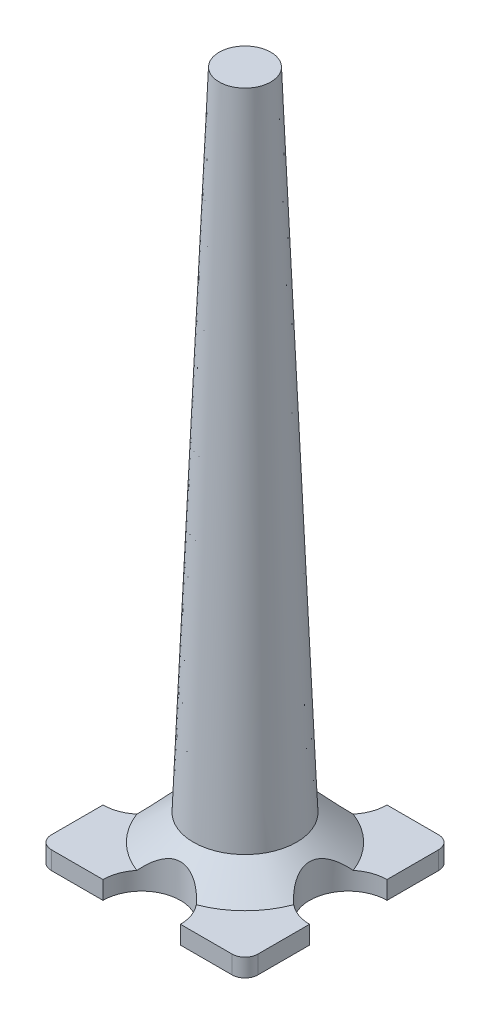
from build123d import *

# Parameters (mm, degrees)
BOSS_EXTRUDE1_DEPTH = 8.89
SKETCH5_R           = 19.05
CUT_EXTRUDE2_DEPTH  = 76.016052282


with BuildPart() as part:
    # Sketch1 → Boss-Extrude1 (new body)
    with BuildSketch(Plane(origin=(0, 0, 0), x_dir=(1, 0, 0), z_dir=(0, 1, 0))):
        with BuildLine():
            Line((44.45, -50.8), (-44.45, -50.8))
            ThreePointArc((-44.45, -50.8), (-48.940128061, -48.940128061), (-50.8, -44.45))
            Line((-50.8, -44.45), (-50.8, 44.45))
            ThreePointArc((-50.8, 44.45), (-48.940128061, 48.940128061), (-44.45, 50.8))
            Line((-44.45, 50.8), (44.45, 50.8))
            ThreePointArc((44.45, 50.8), (48.940128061, 48.940128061), (50.8, 44.45))
            Line((50.8, 44.45), (50.8, -44.45))
            ThreePointArc((50.8, -44.45), (48.940128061, -48.940128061), (44.45, -50.8))
        make_face()
    extrude(amount=BOSS_EXTRUDE1_DEPTH)

    # Sketch2 → Revolve1 (revolve)
    with BuildSketch(Plane.XY, mode=Mode.PRIVATE) as revolve1_sk:
        Polygon((0, 8.89), (0, 21.59), (25.4, 21.59), (41.275, 8.89), align=None)
    revolve(revolve1_sk.sketch.rotate(Axis((0, 37.971899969, 0), (0, -1, 0)), 90), axis=Axis((0, 37.971899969, 0), (0, -1, 0)))

    # Sketch5 → Cut-Extrude2 (cut, through all)
    with BuildSketch(Plane(origin=(0, 21.59, 0), x_dir=(1, 0, 0), z_dir=(0, 1, 0))):
        with Locations((0, 50.8)):
            Circle(SKETCH5_R)
        with Locations((50.8, 0)):
            Circle(SKETCH5_R)
        with Locations((0, -50.8)):
            Circle(SKETCH5_R)
        with Locations((-50.8, 0)):
            Circle(SKETCH5_R)
    extrude(amount=-CUT_EXTRUDE2_DEPTH, mode=Mode.SUBTRACT)

    # Sketch6 → Revolve2 (revolve)
    with BuildSketch(Plane.XY, mode=Mode.PRIVATE) as revolve2_sk:
        Polygon((0, 21.59), (25.4, 21.59), (12.7, 339.09), (0, 339.09), align=None)
    revolve(revolve2_sk.sketch.rotate(Axis((0, 0, 0), (0, 1, 0)), 110.756315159), axis=Axis((0, 0, 0), (0, 1, 0)))


solid = part.part
